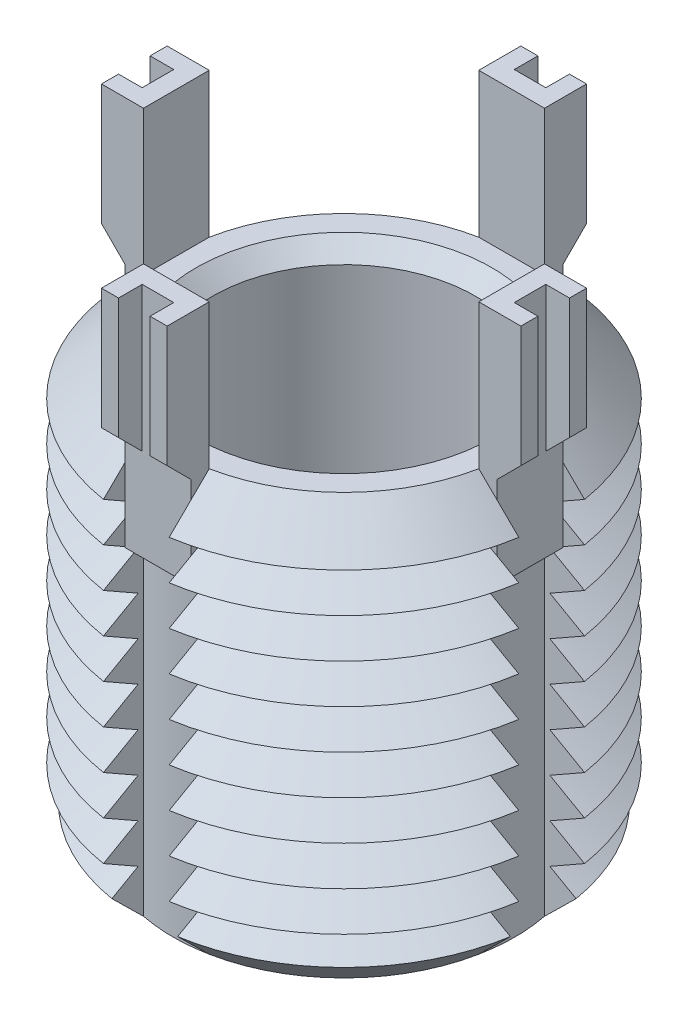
from build123d import *

# Parameters (mm, degrees)
SKETCH1_R               = 8
BOSS_EXTRUDE1_DEPTH     = 16
CHAMFER1_SIZE           = 1.5
LPATTERN1_COUNT         = 9
LPATTERN1_PITCH         = 1.5
CUT_EXTRUDE1_REACH      = 21.596
CIRPATTERN1_COUNT       = 4
BOSS_EXTRUDE3_DEPTH     = 1.25
CIRPATTERN2_COUNT       = 4
CUT_EXTRUDE3_DEPTH      = 25.281032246
CUT_EXTRUDE3_DEPTH_BACK = 25.281032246
SKETCH6_W               = 0.9
SKETCH6_H               = 1.2
SKETCH6_W_2             = 1.2
SKETCH6_H_2             = 0.9
SKETCH7_R               = 5
CUT_EXTRUDE4_DEPTH      = 16
CHAMFER2_SIZE           = 0.625


with BuildPart() as part:
    # Sketch1 → Boss-Extrude1 (new body)
    with BuildSketch(Plane(origin=(0, 0, 0), x_dir=(1, 0, 0), z_dir=(0, 1, 0))):
        with Locations(Location((0, 0, 0), (0, 0, 270))):
            Circle(SKETCH1_R)
    extrude(amount=-BOSS_EXTRUDE1_DEPTH)

    # Chamfer1
    chamfer1_edges = [part.edges().sort_by_distance(p)[0] for p in [
        (0, 0, -8),
        (0, -16, -8),
    ]]
    chamfer(chamfer1_edges, length=CHAMFER1_SIZE)

    # Sketch3 → Cut-Revolve1 (revolve, cut)
    with BuildSketch(Plane(origin=(0, 0, 0), x_dir=(0, 0, -1), z_dir=(1, 0, 0))):
        Polygon((-8, -1.5), (-6.700961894, -2.25), (-8, -3), align=None)
    cut_revolve1 = revolve(axis=Axis((0, 0.885892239, 0), (0, -1, 0)), mode=Mode.SUBTRACT)

    # LPattern1: Cut-Revolve1 ×9
    with Locations(*[(0, -i * LPATTERN1_PITCH, 0) for i in range(1, LPATTERN1_COUNT)]):
        add(cut_revolve1, mode=Mode.SUBTRACT)

    # Cut-Extrude1: up to this cone (the profile starts inside it)
    cut_extrude1_end = Plane(origin=(0, 0, 0), z_dir=(0, 1, 0)).offset(-22.499999) * Cone(1e-06, 67.096, 67.095999, align=(Align.CENTER, Align.CENTER, Align.MIN), mode=Mode.PRIVATE)
    # Sketch4 → Cut-Extrude1 (cut, up to the surface)
    with BuildSketch(Plane(origin=(0, 0, 0), x_dir=(1, 0, 0), z_dir=(0, 1, 0)), mode=Mode.PRIVATE) as cut_extrude1_sk1:
        with BuildLine():
            Line((-6.378675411, 1.25), (-7.901740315, 1.25))
            ThreePointArc((-7.901740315, 1.25), (-8, 0), (-7.901740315, -1.25))
            Line((-7.901740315, -1.25), (-6.378675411, -1.25))
            ThreePointArc((-6.378675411, -1.25), (-6.5, 0), (-6.378675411, 1.25))
        make_face()
    cut_extrude1_tool1 = extrude(cut_extrude1_sk1.sketch, amount=-CUT_EXTRUDE1_REACH, mode=Mode.PRIVATE) & cut_extrude1_end
    cut_extrude1 = cut_extrude1_tool1.solids().sort_by_distance((-7.213371, 0, 0))[0]
    add(cut_extrude1, mode=Mode.SUBTRACT)

    # CirPattern1: Cut-Extrude1 ×4 about axis
    cirpattern1_axis = Axis((0, 0, 0), (0, 1, 0))
    for i in range(1, CIRPATTERN1_COUNT):
        add(cut_extrude1.rotate(cirpattern1_axis, i * 360 / CIRPATTERN1_COUNT), mode=Mode.SUBTRACT)

    # Sketch5 → Boss-Extrude3 (add, symmetric)
    with BuildSketch(Plane(origin=(0, 0, 0), x_dir=(0, 0, -1), z_dir=(1, 0, 0))):
        Polygon((-6.378675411, 5.5), (-6.378675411, -3.5), (-7.078675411, -3.5), (-7.078675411, 0), (-7.978675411, 0.9), (-7.978675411, 5.5), align=None)
    boss_extrude3 = extrude(amount=BOSS_EXTRUDE3_DEPTH, both=True)

    # CirPattern2: Boss-Extrude3 ×4 about axis
    cirpattern2_axis = Axis((0, 0, 0), (0, 1, 0))
    for i in range(1, CIRPATTERN2_COUNT):
        add(boss_extrude3.rotate(cirpattern2_axis, i * 360 / CIRPATTERN2_COUNT))

    # Sketch6 → Cut-Extrude3 (cut, two sides: drawn at the far end of the back side and taken through both)
    with BuildSketch(Plane(origin=(0, 5.5, 0), x_dir=(1, 0, 0), z_dir=(0, 1, 0)).offset(-CUT_EXTRUDE3_DEPTH_BACK)):
        with Locations((-7.528675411, 0)):
            Rectangle(SKETCH6_W, SKETCH6_H)
        with Locations((0, 7.528675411)):
            Rectangle(SKETCH6_W_2, SKETCH6_H_2)
        with Locations((7.528675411, 0)):
            Rectangle(SKETCH6_W, SKETCH6_H)
        with Locations((0, -7.528675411)):
            Rectangle(SKETCH6_W_2, SKETCH6_H_2)
    extrude(amount=CUT_EXTRUDE3_DEPTH + CUT_EXTRUDE3_DEPTH_BACK, mode=Mode.SUBTRACT)

    # Sketch7 → Cut-Extrude4 (cut)
    with BuildSketch(Plane(origin=(0, 0, 0), x_dir=(1, 0, 0), z_dir=(0, 1, 0))):
        with Locations(Location((0, 0, 0), (0, 0, 270))):
            Circle(SKETCH7_R)
    extrude(amount=-CUT_EXTRUDE4_DEPTH, mode=Mode.SUBTRACT)

    # Chamfer2
    chamfer2_edges = [part.edges().sort_by_distance(p)[0] for p in [
        (0, 0, -5),
        (0, -16, -5),
    ]]
    chamfer(chamfer2_edges, length=CHAMFER2_SIZE)


solid = part.part
